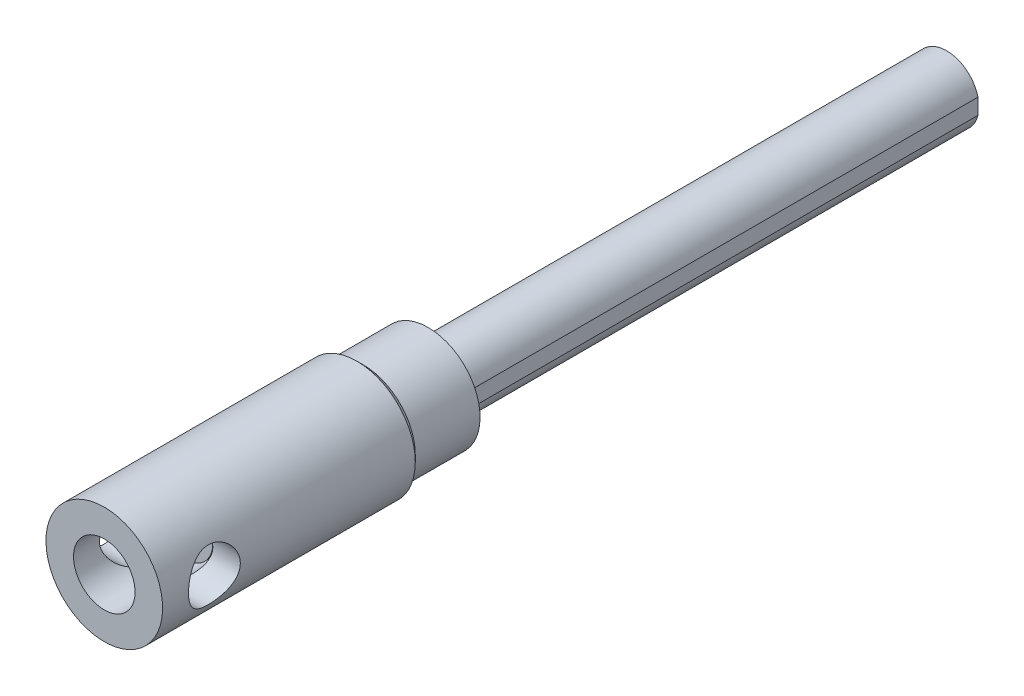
ISO-10303-21;
HEADER;
FILE_DESCRIPTION(('STEP AP214'),'2;1');
FILE_NAME('part.step','',(''),(''),'','','');
FILE_SCHEMA(('AUTOMOTIVE_DESIGN { 1 0 10303 214 1 1 1 1 }'));
ENDSEC;
DATA;
#1=APPLICATION_CONTEXT('core data for automotive mechanical design processes');
#2=APPLICATION_PROTOCOL_DEFINITION('international standard','automotive_design',2000,#1);
#3=PRODUCT_CONTEXT('',#1,'mechanical');
#4=PRODUCT('Part','Part','',(#3));
#5=PRODUCT_RELATED_PRODUCT_CATEGORY('part','',(#4));
#6=PRODUCT_DEFINITION_FORMATION('','',#4);
#7=PRODUCT_DEFINITION_CONTEXT('part definition',#1,'design');
#8=PRODUCT_DEFINITION('design','',#6,#7);
#9=PRODUCT_DEFINITION_SHAPE('','',#8);
#10=(LENGTH_UNIT() NAMED_UNIT(*) SI_UNIT(.MILLI.,.METRE.));
#11=(NAMED_UNIT(*) PLANE_ANGLE_UNIT() SI_UNIT($,.RADIAN.));
#12=(NAMED_UNIT(*) SI_UNIT($,.STERADIAN.) SOLID_ANGLE_UNIT());
#13=UNCERTAINTY_MEASURE_WITH_UNIT(LENGTH_MEASURE(1.E-05),#10,'distance_accuracy_value','');
#14=(GEOMETRIC_REPRESENTATION_CONTEXT(3) GLOBAL_UNCERTAINTY_ASSIGNED_CONTEXT((#13)) GLOBAL_UNIT_ASSIGNED_CONTEXT((#10,
#11,#12)) REPRESENTATION_CONTEXT('',''));
#15=CARTESIAN_POINT('',(0.,0.,0.));
#16=DIRECTION('',(0.,0.,1.));
#17=DIRECTION('',(1.,0.,0.));
#18=AXIS2_PLACEMENT_3D('',#15,#16,#17);
#19=CARTESIAN_POINT('',(2.3094010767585,0.,115.));
#20=DIRECTION('',(-0.866025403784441,0.5,0.));
#21=DIRECTION('',(-0.5,-0.866025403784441,0.));
#22=AXIS2_PLACEMENT_3D('',#19,#20,#21);
#23=PLANE('',#22);
#24=DIRECTION('',(0.,0.,1.));
#25=VECTOR('',#24,1.);
#26=CARTESIAN_POINT('',(1.15470053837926,-2.,115.));
#27=LINE('',#26,#25);
#28=CARTESIAN_POINT('',(1.15470053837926,-2.,115.));
#29=VERTEX_POINT('',#28);
#30=CARTESIAN_POINT('',(1.15470053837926,-2.,117.5));
#31=VERTEX_POINT('',#30);
#32=EDGE_CURVE('E291',#29,#31,#27,.T.);
#33=ORIENTED_EDGE('',*,*,#32,.T.);
#34=DIRECTION('',(-0.5,-0.866025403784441,0.));
#35=VECTOR('',#34,1.);
#36=CARTESIAN_POINT('',(2.3094010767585,0.,117.5));
#37=LINE('',#36,#35);
#38=CARTESIAN_POINT('',(2.3094010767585,0.,117.5));
#39=VERTEX_POINT('',#38);
#40=EDGE_CURVE('E29',#39,#31,#37,.T.);
#41=ORIENTED_EDGE('',*,*,#40,.F.);
#42=DIRECTION('',(0.,0.,1.));
#43=VECTOR('',#42,1.);
#44=CARTESIAN_POINT('',(2.3094010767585,0.,115.));
#45=LINE('',#44,#43);
#46=CARTESIAN_POINT('',(2.3094010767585,0.,115.));
#47=VERTEX_POINT('',#46);
#48=EDGE_CURVE('E33',#47,#39,#45,.T.);
#49=ORIENTED_EDGE('',*,*,#48,.F.);
#50=DIRECTION('',(-0.5,-0.866025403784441,0.));
#51=VECTOR('',#50,1.);
#52=CARTESIAN_POINT('',(2.3094010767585,0.,115.));
#53=LINE('',#52,#51);
#54=EDGE_CURVE('E252',#47,#29,#53,.T.);
#55=ORIENTED_EDGE('',*,*,#54,.T.);
#56=EDGE_LOOP('',(#33,#41,#49,#55));
#57=FACE_BOUND('',#56,.T.);
#58=ADVANCED_FACE('F14',(#57),#23,.T.);
#59=CARTESIAN_POINT('',(-1.15470053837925,-2.,115.));
#60=DIRECTION('',(0.,-1.,0.));
#61=DIRECTION('',(0.,0.,-1.));
#62=AXIS2_PLACEMENT_3D('',#59,#60,#61);
#63=PLANE('',#62);
#64=DIRECTION('',(0.,0.,1.));
#65=VECTOR('',#64,1.);
#66=CARTESIAN_POINT('',(-1.15470053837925,-2.,115.));
#67=LINE('',#66,#65);
#68=CARTESIAN_POINT('',(-1.15470053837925,-2.,115.));
#69=VERTEX_POINT('',#68);
#70=CARTESIAN_POINT('',(-1.15470053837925,-2.,117.5));
#71=VERTEX_POINT('',#70);
#72=EDGE_CURVE('E289',#69,#71,#67,.T.);
#73=ORIENTED_EDGE('',*,*,#72,.T.);
#74=DIRECTION('',(1.,0.,0.));
#75=VECTOR('',#74,1.);
#76=CARTESIAN_POINT('',(-1.15470053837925,-2.,117.5));
#77=LINE('',#76,#75);
#78=EDGE_CURVE('E262',#71,#31,#77,.T.);
#79=ORIENTED_EDGE('',*,*,#78,.T.);
#80=ORIENTED_EDGE('',*,*,#32,.F.);
#81=DIRECTION('',(1.,0.,0.));
#82=VECTOR('',#81,1.);
#83=CARTESIAN_POINT('',(-1.15470053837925,-2.,115.));
#84=LINE('',#83,#82);
#85=EDGE_CURVE('E278',#69,#29,#84,.T.);
#86=ORIENTED_EDGE('',*,*,#85,.F.);
#87=EDGE_LOOP('',(#73,#79,#80,#86));
#88=FACE_BOUND('',#87,.T.);
#89=ADVANCED_FACE('F166',(#88),#63,.F.);
#90=CARTESIAN_POINT('',(-2.3094010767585,0.,115.));
#91=DIRECTION('',(-0.866025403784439,-0.5,0.));
#92=DIRECTION('',(0.5,-0.866025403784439,0.));
#93=AXIS2_PLACEMENT_3D('',#90,#91,#92);
#94=PLANE('',#93);
#95=DIRECTION('',(0.,0.,1.));
#96=VECTOR('',#95,1.);
#97=CARTESIAN_POINT('',(-2.3094010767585,0.,115.));
#98=LINE('',#97,#96);
#99=CARTESIAN_POINT('',(-2.3094010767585,0.,115.));
#100=VERTEX_POINT('',#99);
#101=CARTESIAN_POINT('',(-2.3094010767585,0.,117.5));
#102=VERTEX_POINT('',#101);
#103=EDGE_CURVE('E287',#100,#102,#98,.T.);
#104=ORIENTED_EDGE('',*,*,#103,.T.);
#105=DIRECTION('',(0.5,-0.866025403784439,0.));
#106=VECTOR('',#105,1.);
#107=CARTESIAN_POINT('',(-2.3094010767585,0.,117.5));
#108=LINE('',#107,#106);
#109=EDGE_CURVE('E259',#102,#71,#108,.T.);
#110=ORIENTED_EDGE('',*,*,#109,.T.);
#111=ORIENTED_EDGE('',*,*,#72,.F.);
#112=DIRECTION('',(0.5,-0.866025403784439,0.));
#113=VECTOR('',#112,1.);
#114=CARTESIAN_POINT('',(-2.3094010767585,0.,115.));
#115=LINE('',#114,#113);
#116=EDGE_CURVE('E275',#100,#69,#115,.T.);
#117=ORIENTED_EDGE('',*,*,#116,.F.);
#118=EDGE_LOOP('',(#104,#110,#111,#117));
#119=FACE_BOUND('',#118,.T.);
#120=ADVANCED_FACE('F171',(#119),#94,.F.);
#121=CARTESIAN_POINT('',(-2.3094010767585,0.,115.));
#122=DIRECTION('',(0.866025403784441,-0.5,0.));
#123=DIRECTION('',(0.5,0.866025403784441,0.));
#124=AXIS2_PLACEMENT_3D('',#121,#122,#123);
#125=PLANE('',#124);
#126=DIRECTION('',(0.,0.,1.));
#127=VECTOR('',#126,1.);
#128=CARTESIAN_POINT('',(-1.15470053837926,2.,115.));
#129=LINE('',#128,#127);
#130=CARTESIAN_POINT('',(-1.15470053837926,2.,115.));
#131=VERTEX_POINT('',#130);
#132=CARTESIAN_POINT('',(-1.15470053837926,2.,117.5));
#133=VERTEX_POINT('',#132);
#134=EDGE_CURVE('E285',#131,#133,#129,.T.);
#135=ORIENTED_EDGE('',*,*,#134,.T.);
#136=DIRECTION('',(0.5,0.866025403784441,0.));
#137=VECTOR('',#136,1.);
#138=CARTESIAN_POINT('',(-2.3094010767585,0.,117.5));
#139=LINE('',#138,#137);
#140=EDGE_CURVE('E256',#102,#133,#139,.T.);
#141=ORIENTED_EDGE('',*,*,#140,.F.);
#142=ORIENTED_EDGE('',*,*,#103,.F.);
#143=DIRECTION('',(0.5,0.866025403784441,0.));
#144=VECTOR('',#143,1.);
#145=CARTESIAN_POINT('',(-2.3094010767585,0.,115.));
#146=LINE('',#145,#144);
#147=EDGE_CURVE('E272',#100,#131,#146,.T.);
#148=ORIENTED_EDGE('',*,*,#147,.T.);
#149=EDGE_LOOP('',(#135,#141,#142,#148));
#150=FACE_BOUND('',#149,.T.);
#151=ADVANCED_FACE('F184',(#150),#125,.T.);
#152=CARTESIAN_POINT('',(1.15470053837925,2.,115.));
#153=DIRECTION('',(0.,1.,0.));
#154=DIRECTION('',(-1.,0.,0.));
#155=AXIS2_PLACEMENT_3D('',#152,#153,#154);
#156=PLANE('',#155);
#157=DIRECTION('',(0.,0.,1.));
#158=VECTOR('',#157,1.);
#159=CARTESIAN_POINT('',(1.15470053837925,2.,115.));
#160=LINE('',#159,#158);
#161=CARTESIAN_POINT('',(1.15470053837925,2.,115.));
#162=VERTEX_POINT('',#161);
#163=CARTESIAN_POINT('',(1.15470053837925,2.,117.5));
#164=VERTEX_POINT('',#163);
#165=EDGE_CURVE('E283',#162,#164,#160,.T.);
#166=ORIENTED_EDGE('',*,*,#165,.T.);
#167=DIRECTION('',(-1.,0.,0.));
#168=VECTOR('',#167,1.);
#169=CARTESIAN_POINT('',(1.15470053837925,2.,117.5));
#170=LINE('',#169,#168);
#171=EDGE_CURVE('E253',#164,#133,#170,.T.);
#172=ORIENTED_EDGE('',*,*,#171,.T.);
#173=ORIENTED_EDGE('',*,*,#134,.F.);
#174=DIRECTION('',(-1.,0.,0.));
#175=VECTOR('',#174,1.);
#176=CARTESIAN_POINT('',(1.15470053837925,2.,115.));
#177=LINE('',#176,#175);
#178=EDGE_CURVE('E269',#162,#131,#177,.T.);
#179=ORIENTED_EDGE('',*,*,#178,.F.);
#180=EDGE_LOOP('',(#166,#172,#173,#179));
#181=FACE_BOUND('',#180,.T.);
#182=ADVANCED_FACE('F180',(#181),#156,.F.);
#183=CARTESIAN_POINT('',(2.3094010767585,0.,115.));
#184=DIRECTION('',(0.866025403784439,0.5,0.));
#185=DIRECTION('',(-0.5,0.866025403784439,0.));
#186=AXIS2_PLACEMENT_3D('',#183,#184,#185);
#187=PLANE('',#186);
#188=DIRECTION('',(-0.5,0.866025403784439,0.));
#189=VECTOR('',#188,1.);
#190=CARTESIAN_POINT('',(2.3094010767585,0.,115.));
#191=LINE('',#190,#189);
#192=EDGE_CURVE('E266',#47,#162,#191,.T.);
#193=ORIENTED_EDGE('',*,*,#192,.F.);
#194=ORIENTED_EDGE('',*,*,#48,.T.);
#195=DIRECTION('',(-0.5,0.866025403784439,0.));
#196=VECTOR('',#195,1.);
#197=CARTESIAN_POINT('',(2.3094010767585,0.,117.5));
#198=LINE('',#197,#196);
#199=EDGE_CURVE('E249',#39,#164,#198,.T.);
#200=ORIENTED_EDGE('',*,*,#199,.T.);
#201=ORIENTED_EDGE('',*,*,#165,.F.);
#202=EDGE_LOOP('',(#193,#194,#200,#201));
#203=FACE_BOUND('',#202,.T.);
#204=ADVANCED_FACE('F177',(#203),#187,.F.);
#205=CARTESIAN_POINT('',(3.46410161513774,2.,115.));
#206=DIRECTION('',(0.,0.,-1.));
#207=DIRECTION('',(0.,1.,0.));
#208=AXIS2_PLACEMENT_3D('',#205,#206,#207);
#209=PLANE('',#208);
#210=ORIENTED_EDGE('',*,*,#54,.F.);
#211=ORIENTED_EDGE('',*,*,#192,.T.);
#212=ORIENTED_EDGE('',*,*,#178,.T.);
#213=ORIENTED_EDGE('',*,*,#147,.F.);
#214=ORIENTED_EDGE('',*,*,#116,.T.);
#215=ORIENTED_EDGE('',*,*,#85,.T.);
#216=EDGE_LOOP('',(#210,#211,#212,#213,#214,#215));
#217=FACE_BOUND('',#216,.T.);
#218=ADVANCED_FACE('F176',(#217),#209,.F.);
#219=CARTESIAN_POINT('',(0.,0.,117.5));
#220=DIRECTION('',(0.,0.,1.));
#221=DIRECTION('',(0.,-1.,0.));
#222=AXIS2_PLACEMENT_3D('',#219,#220,#221);
#223=PLANE('',#222);
#224=CARTESIAN_POINT('',(0.,0.,117.5));
#225=DIRECTION('',(0.,0.,1.));
#226=DIRECTION('',(0.,-1.,0.));
#227=AXIS2_PLACEMENT_3D('',#224,#225,#226);
#228=CIRCLE('',#227,4.25);
#229=CARTESIAN_POINT('',(0.,-4.25,117.5));
#230=VERTEX_POINT('',#229);
#231=EDGE_CURVE('E9',#230,#230,#228,.T.);
#232=ORIENTED_EDGE('',*,*,#231,.T.);
#233=EDGE_LOOP('',(#232));
#234=FACE_BOUND('',#233,.T.);
#235=ORIENTED_EDGE('',*,*,#199,.F.);
#236=ORIENTED_EDGE('',*,*,#40,.T.);
#237=ORIENTED_EDGE('',*,*,#78,.F.);
#238=ORIENTED_EDGE('',*,*,#109,.F.);
#239=ORIENTED_EDGE('',*,*,#140,.T.);
#240=ORIENTED_EDGE('',*,*,#171,.F.);
#241=EDGE_LOOP('',(#235,#236,#237,#238,#239,#240));
#242=FACE_BOUND('',#241,.T.);
#243=ADVANCED_FACE('F16',(#234,#242),#223,.T.);
#244=CARTESIAN_POINT('',(0.,0.,112.5));
#245=DIRECTION('',(0.,0.,1.));
#246=DIRECTION('',(0.,-1.,0.));
#247=AXIS2_PLACEMENT_3D('',#244,#245,#246);
#248=CYLINDRICAL_SURFACE('',#247,4.25);
#249=CARTESIAN_POINT('',(0.,0.,112.5));
#250=DIRECTION('',(0.,0.,1.));
#251=DIRECTION('',(0.,-1.,0.));
#252=AXIS2_PLACEMENT_3D('',#249,#250,#251);
#253=CIRCLE('',#252,4.25);
#254=CARTESIAN_POINT('',(0.,-4.25,112.5));
#255=VERTEX_POINT('',#254);
#256=EDGE_CURVE('E22',#255,#255,#253,.T.);
#257=ORIENTED_EDGE('',*,*,#256,.T.);
#258=EDGE_LOOP('',(#257));
#259=FACE_BOUND('',#258,.T.);
#260=ORIENTED_EDGE('',*,*,#231,.F.);
#261=EDGE_LOOP('',(#260));
#262=FACE_BOUND('',#261,.T.);
#263=ADVANCED_FACE('F191',(#259,#262),#248,.T.);
#264=CARTESIAN_POINT('',(0.,0.,0.));
#265=DIRECTION('',(0.,0.,1.));
#266=DIRECTION('',(-1.,0.,0.));
#267=AXIS2_PLACEMENT_3D('',#264,#265,#266);
#268=PLANE('',#267);
#269=DIRECTION('',(0.,-1.,0.));
#270=VECTOR('',#269,1.);
#271=CARTESIAN_POINT('',(4.85,-1.21552457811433,0.));
#272=LINE('',#271,#270);
#273=CARTESIAN_POINT('',(4.85,1.21552457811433,0.));
#274=VERTEX_POINT('',#273);
#275=CARTESIAN_POINT('',(4.85,-1.21552457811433,0.));
#276=VERTEX_POINT('',#275);
#277=EDGE_CURVE('E91',#274,#276,#272,.T.);
#278=ORIENTED_EDGE('',*,*,#277,.T.);
#279=CARTESIAN_POINT('',(0.,0.,0.));
#280=DIRECTION('',(0.,0.,1.));
#281=DIRECTION('',(-1.,0.,0.));
#282=AXIS2_PLACEMENT_3D('',#279,#280,#281);
#283=CIRCLE('',#282,5.);
#284=EDGE_CURVE('E83',#274,#276,#283,.T.);
#285=ORIENTED_EDGE('',*,*,#284,.F.);
#286=EDGE_LOOP('',(#278,#285));
#287=FACE_BOUND('',#286,.T.);
#288=ADVANCED_FACE('F95',(#287),#268,.F.);
#289=CARTESIAN_POINT('',(4.85,-1.21552457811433,100.));
#290=DIRECTION('',(1.,0.,0.));
#291=DIRECTION('',(0.,0.,1.));
#292=AXIS2_PLACEMENT_3D('',#289,#290,#291);
#293=PLANE('',#292);
#294=DIRECTION('',(0.,1.,0.));
#295=VECTOR('',#294,1.);
#296=CARTESIAN_POINT('',(4.85,8.,80.));
#297=LINE('',#296,#295);
#298=CARTESIAN_POINT('',(4.85,-1.21552457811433,80.));
#299=VERTEX_POINT('',#298);
#300=CARTESIAN_POINT('',(4.85,1.21552457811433,80.));
#301=VERTEX_POINT('',#300);
#302=EDGE_CURVE('E246',#299,#301,#297,.T.);
#303=ORIENTED_EDGE('',*,*,#302,.F.);
#304=DIRECTION('',(0.,0.,-1.));
#305=VECTOR('',#304,1.);
#306=CARTESIAN_POINT('',(4.85,-1.21552457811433,100.));
#307=LINE('',#306,#305);
#308=EDGE_CURVE('E88',#299,#276,#307,.T.);
#309=ORIENTED_EDGE('',*,*,#308,.T.);
#310=ORIENTED_EDGE('',*,*,#277,.F.);
#311=DIRECTION('',(0.,0.,-1.));
#312=VECTOR('',#311,1.);
#313=CARTESIAN_POINT('',(4.85,1.21552457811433,100.));
#314=LINE('',#313,#312);
#315=EDGE_CURVE('E78',#301,#274,#314,.T.);
#316=ORIENTED_EDGE('',*,*,#315,.F.);
#317=EDGE_LOOP('',(#303,#309,#310,#316));
#318=FACE_BOUND('',#317,.T.);
#319=ADVANCED_FACE('F92',(#318),#293,.T.);
#320=CARTESIAN_POINT('',(0.,0.,100.));
#321=DIRECTION('',(0.,0.,-1.));
#322=DIRECTION('',(1.,0.,0.));
#323=AXIS2_PLACEMENT_3D('',#320,#321,#322);
#324=CYLINDRICAL_SURFACE('',#323,5.);
#325=ORIENTED_EDGE('',*,*,#308,.F.);
#326=CARTESIAN_POINT('',(0.,0.,80.));
#327=DIRECTION('',(0.,0.,1.));
#328=DIRECTION('',(1.025516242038E-09,-1.,0.));
#329=AXIS2_PLACEMENT_3D('',#326,#327,#328);
#330=CIRCLE('',#329,5.);
#331=EDGE_CURVE('E84',#299,#301,#330,.F.);
#332=ORIENTED_EDGE('',*,*,#331,.T.);
#333=ORIENTED_EDGE('',*,*,#315,.T.);
#334=ORIENTED_EDGE('',*,*,#284,.T.);
#335=EDGE_LOOP('',(#325,#332,#333,#334));
#336=FACE_BOUND('',#335,.T.);
#337=ADVANCED_FACE('F81',(#336),#324,.T.);
#338=CARTESIAN_POINT('',(0.,8.,80.));
#339=DIRECTION('',(0.,0.,1.));
#340=DIRECTION('',(0.,-1.,0.));
#341=AXIS2_PLACEMENT_3D('',#338,#339,#340);
#342=PLANE('',#341);
#343=CARTESIAN_POINT('',(0.,0.,80.));
#344=DIRECTION('',(0.,0.,-1.));
#345=DIRECTION('',(0.,1.,0.));
#346=AXIS2_PLACEMENT_3D('',#343,#344,#345);
#347=CIRCLE('',#346,8.);
#348=CARTESIAN_POINT('',(0.,8.,80.));
#349=VERTEX_POINT('',#348);
#350=EDGE_CURVE('E222',#349,#349,#347,.T.);
#351=ORIENTED_EDGE('',*,*,#350,.T.);
#352=EDGE_LOOP('',(#351));
#353=FACE_BOUND('',#352,.T.);
#354=ORIENTED_EDGE('',*,*,#331,.F.);
#355=ORIENTED_EDGE('',*,*,#302,.T.);
#356=EDGE_LOOP('',(#354,#355));
#357=FACE_BOUND('',#356,.T.);
#358=ADVANCED_FACE('F126',(#353,#357),#342,.F.);
#359=CARTESIAN_POINT('',(0.,0.,80.));
#360=DIRECTION('',(0.,0.,-1.));
#361=DIRECTION('',(0.,1.,0.));
#362=AXIS2_PLACEMENT_3D('',#359,#360,#361);
#363=CYLINDRICAL_SURFACE('',#362,8.);
#364=ORIENTED_EDGE('',*,*,#350,.F.);
#365=EDGE_LOOP('',(#364));
#366=FACE_BOUND('',#365,.T.);
#367=CARTESIAN_POINT('',(0.,0.,90.));
#368=DIRECTION('',(0.,0.,-1.));
#369=DIRECTION('',(0.,1.,0.));
#370=AXIS2_PLACEMENT_3D('',#367,#368,#369);
#371=CIRCLE('',#370,8.);
#372=CARTESIAN_POINT('',(0.,8.,90.));
#373=VERTEX_POINT('',#372);
#374=EDGE_CURVE('E220',#373,#373,#371,.T.);
#375=ORIENTED_EDGE('',*,*,#374,.T.);
#376=EDGE_LOOP('',(#375));
#377=FACE_BOUND('',#376,.T.);
#378=ADVANCED_FACE('F151',(#366,#377),#363,.T.);
#379=CARTESIAN_POINT('',(0.,0.,90.));
#380=DIRECTION('',(0.,0.,1.));
#381=DIRECTION('',(0.,-1.,0.));
#382=AXIS2_PLACEMENT_3D('',#379,#380,#381);
#383=CONICAL_SURFACE('',#382,8.,0.785398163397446);
#384=CARTESIAN_POINT('',(0.,0.,91.));
#385=DIRECTION('',(0.,0.,1.));
#386=DIRECTION('',(0.,-1.,0.));
#387=AXIS2_PLACEMENT_3D('',#384,#385,#386);
#388=CIRCLE('',#387,9.);
#389=CARTESIAN_POINT('',(0.,-9.,91.));
#390=VERTEX_POINT('',#389);
#391=EDGE_CURVE('E145',#390,#390,#388,.T.);
#392=ORIENTED_EDGE('',*,*,#391,.F.);
#393=EDGE_LOOP('',(#392));
#394=FACE_BOUND('',#393,.T.);
#395=ORIENTED_EDGE('',*,*,#374,.F.);
#396=EDGE_LOOP('',(#395));
#397=FACE_BOUND('',#396,.T.);
#398=ADVANCED_FACE('F124',(#394,#397),#383,.T.);
#399=CARTESIAN_POINT('',(0.,0.,80.));
#400=DIRECTION('',(0.,0.,-1.));
#401=DIRECTION('',(0.,1.,0.));
#402=AXIS2_PLACEMENT_3D('',#399,#400,#401);
#403=CYLINDRICAL_SURFACE('',#402,9.);
#404=ORIENTED_EDGE('',*,*,#391,.T.);
#405=EDGE_LOOP('',(#404));
#406=FACE_BOUND('',#405,.T.);
#407=CARTESIAN_POINT('',(-9.,0.,126.));
#408=CARTESIAN_POINT('',(-8.99999931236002,-0.106543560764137,125.999999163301));
#409=CARTESIAN_POINT('',(-8.99810295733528,-0.21311453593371,125.995737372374));
#410=CARTESIAN_POINT('',(-8.99056534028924,-0.425487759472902,125.978733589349));
#411=CARTESIAN_POINT('',(-8.9849219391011,-0.531289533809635,125.965986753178));
#412=CARTESIAN_POINT('',(-8.97002203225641,-0.741497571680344,125.932115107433));
#413=CARTESIAN_POINT('',(-8.96075877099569,-0.8459008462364,125.910974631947));
#414=CARTESIAN_POINT('',(-8.93886560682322,-1.05237393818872,125.860547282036));
#415=CARTESIAN_POINT('',(-8.92623432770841,-1.15444278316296,125.831257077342));
#416=CARTESIAN_POINT('',(-8.88385509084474,-1.45528706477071,125.731826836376));
#417=CARTESIAN_POINT('',(-8.84954694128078,-1.64969223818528,125.649964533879));
#418=CARTESIAN_POINT('',(-8.7720569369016,-2.02169397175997,125.457842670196));
#419=CARTESIAN_POINT('',(-8.7288771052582,-2.1992943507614,125.34758958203));
#420=CARTESIAN_POINT('',(-8.63520005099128,-2.5429519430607,125.095329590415));
#421=CARTESIAN_POINT('',(-8.58444255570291,-2.70796463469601,124.951994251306));
#422=CARTESIAN_POINT('',(-8.48237167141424,-3.01251193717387,124.640513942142));
#423=CARTESIAN_POINT('',(-8.43105797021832,-3.15203136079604,124.472354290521));
#424=CARTESIAN_POINT('',(-8.33031613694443,-3.40970641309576,124.10407902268));
#425=CARTESIAN_POINT('',(-8.28116793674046,-3.52616342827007,123.902678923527));
#426=CARTESIAN_POINT('',(-8.21620901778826,-3.67379855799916,123.58644164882));
#427=CARTESIAN_POINT('',(-8.19601074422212,-3.7185134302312,123.478630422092));
#428=CARTESIAN_POINT('',(-8.15924882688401,-3.79849956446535,123.258980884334));
#429=CARTESIAN_POINT('',(-8.14268322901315,-3.83377590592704,123.147144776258));
#430=CARTESIAN_POINT('',(-8.11458487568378,-3.89288163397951,122.926209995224));
#431=CARTESIAN_POINT('',(-8.10283476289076,-3.91721191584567,122.8172725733));
#432=CARTESIAN_POINT('',(-8.08362129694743,-3.95670961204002,122.59742166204));
#433=CARTESIAN_POINT('',(-8.07615587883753,-3.97188144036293,122.486509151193));
#434=CARTESIAN_POINT('',(-8.06579894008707,-3.99287182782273,122.263627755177));
#435=CARTESIAN_POINT('',(-8.06290582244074,-3.99869365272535,122.151659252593));
#436=CARTESIAN_POINT('',(-8.06180452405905,-4.0009136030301,121.927610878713));
#437=CARTESIAN_POINT('',(-8.06359604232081,-3.9973123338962,121.815531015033));
#438=CARTESIAN_POINT('',(-8.0714233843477,-3.98148137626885,121.602272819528));
#439=CARTESIAN_POINT('',(-8.07706352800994,-3.97005575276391,121.501019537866));
#440=CARTESIAN_POINT('',(-8.09197245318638,-3.93957606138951,121.299928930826));
#441=CARTESIAN_POINT('',(-8.10124240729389,-3.92051952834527,121.200092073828));
#442=CARTESIAN_POINT('',(-8.13408651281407,-3.85217674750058,120.903762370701));
#443=CARTESIAN_POINT('',(-8.16270181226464,-3.79170447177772,120.710282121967));
#444=CARTESIAN_POINT('',(-8.23081734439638,-3.64150006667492,120.332101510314));
#445=CARTESIAN_POINT('',(-8.27054749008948,-3.55114161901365,120.147695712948));
#446=CARTESIAN_POINT('',(-8.35638151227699,-3.3441634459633,119.795856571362));
#447=CARTESIAN_POINT('',(-8.40248806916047,-3.22753266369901,119.62843041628));
#448=CARTESIAN_POINT('',(-8.50133279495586,-2.95801583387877,119.298170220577));
#449=CARTESIAN_POINT('',(-8.5542794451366,-2.80270476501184,119.137372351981));
#450=CARTESIAN_POINT('',(-8.65709798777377,-2.46687651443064,118.843365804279));
#451=CARTESIAN_POINT('',(-8.70696894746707,-2.28635173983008,118.710165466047));
#452=CARTESIAN_POINT('',(-8.79984898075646,-1.89830549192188,118.471573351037));
#453=CARTESIAN_POINT('',(-8.84261183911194,-1.69014406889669,118.367119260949));
#454=CARTESIAN_POINT('',(-8.91451161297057,-1.25681485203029,118.195446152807));
#455=CARTESIAN_POINT('',(-8.94365711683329,-1.03165788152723,118.128203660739));
#456=CARTESIAN_POINT('',(-8.98336516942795,-0.587641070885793,118.037376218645));
#457=CARTESIAN_POINT('',(-8.99508492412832,-0.369442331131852,118.011066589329));
#458=CARTESIAN_POINT('',(-9.00240007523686,0.0685540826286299,117.994593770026));
#459=CARTESIAN_POINT('',(-8.99800094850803,0.288351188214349,118.004418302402));
#460=CARTESIAN_POINT('',(-8.97430591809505,0.709814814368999,118.058087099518));
#461=CARTESIAN_POINT('',(-8.95589038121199,0.911792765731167,118.099921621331));
#462=CARTESIAN_POINT('',(-8.90701082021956,1.30558421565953,118.213516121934));
#463=CARTESIAN_POINT('',(-8.87654533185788,1.4973964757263,118.285279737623));
#464=CARTESIAN_POINT('',(-8.80524764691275,1.87220783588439,118.45897713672));
#465=CARTESIAN_POINT('',(-8.76412168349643,2.05474529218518,118.56178231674));
#466=CARTESIAN_POINT('',(-8.67576208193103,2.40063957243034,118.793705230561));
#467=CARTESIAN_POINT('',(-8.62852578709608,2.56398799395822,118.92283442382));
#468=CARTESIAN_POINT('',(-8.52825739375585,2.88073032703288,119.215823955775));
#469=CARTESIAN_POINT('',(-8.47506500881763,3.03226090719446,119.381644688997));
#470=CARTESIAN_POINT('',(-8.37207677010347,3.30602071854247,119.737147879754));
#471=CARTESIAN_POINT('',(-8.32228212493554,3.42823956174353,119.926838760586));
#472=CARTESIAN_POINT('',(-8.25404075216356,3.58807434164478,120.228245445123));
#473=CARTESIAN_POINT('',(-8.23214803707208,3.63788387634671,120.332879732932));
#474=CARTESIAN_POINT('',(-8.19154569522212,3.72840991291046,120.546588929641));
#475=CARTESIAN_POINT('',(-8.17283464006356,3.76913049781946,120.655661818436));
#476=CARTESIAN_POINT('',(-8.13929816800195,3.84101557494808,120.877421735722));
#477=CARTESIAN_POINT('',(-8.12447050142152,3.87218560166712,120.990106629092));
#478=CARTESIAN_POINT('',(-8.0992771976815,3.92460929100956,121.218249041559));
#479=CARTESIAN_POINT('',(-8.08891105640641,3.94586407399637,121.33370624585));
#480=CARTESIAN_POINT('',(-8.07374935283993,3.97678770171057,121.556479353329));
#481=CARTESIAN_POINT('',(-8.06855529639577,3.98728755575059,121.663653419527));
#482=CARTESIAN_POINT('',(-8.06245450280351,3.99960939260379,121.87865985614));
#483=CARTESIAN_POINT('',(-8.06154919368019,4.00142848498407,121.986492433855));
#484=CARTESIAN_POINT('',(-8.06406616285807,3.99635429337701,122.201844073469));
#485=CARTESIAN_POINT('',(-8.06748593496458,3.98946605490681,122.309363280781));
#486=CARTESIAN_POINT('',(-8.07851431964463,3.96708318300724,122.523297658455));
#487=CARTESIAN_POINT('',(-8.08612450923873,3.95158530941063,122.629712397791));
#488=CARTESIAN_POINT('',(-8.11370655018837,3.89481025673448,122.933253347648));
#489=CARTESIAN_POINT('',(-8.13866591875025,3.8428451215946,123.128043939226));
#490=CARTESIAN_POINT('',(-8.19957700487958,3.71108221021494,123.505998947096));
#491=CARTESIAN_POINT('',(-8.23553189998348,3.6312763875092,123.689159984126));
#492=CARTESIAN_POINT('',(-8.31722161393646,3.44024324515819,124.051664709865));
#493=CARTESIAN_POINT('',(-8.36343549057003,3.32733013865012,124.230011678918));
#494=CARTESIAN_POINT('',(-8.45929191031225,3.07546946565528,124.566253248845));
#495=CARTESIAN_POINT('',(-8.50893588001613,2.93651102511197,124.724139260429));
#496=CARTESIAN_POINT('',(-8.61126362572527,2.62217220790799,125.029240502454));
#497=CARTESIAN_POINT('',(-8.66383343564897,2.44466910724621,125.174314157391));
#498=CARTESIAN_POINT('',(-8.76186799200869,2.0658662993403,125.432884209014));
#499=CARTESIAN_POINT('',(-8.80732948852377,1.86455578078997,125.546366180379));
#500=CARTESIAN_POINT('',(-8.86614466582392,1.55009155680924,125.689219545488));
#501=CARTESIAN_POINT('',(-8.88411858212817,1.44376115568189,125.732125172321));
#502=CARTESIAN_POINT('',(-8.91658812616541,1.2273511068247,125.808773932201));
#503=CARTESIAN_POINT('',(-8.93108542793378,1.1172732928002,125.842521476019));
#504=CARTESIAN_POINT('',(-8.95614098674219,0.894475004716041,125.900402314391));
#505=CARTESIAN_POINT('',(-8.96670865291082,0.781761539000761,125.924558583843));
#506=CARTESIAN_POINT('',(-8.98362931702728,0.554414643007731,125.963066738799));
#507=CARTESIAN_POINT('',(-8.98998524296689,0.439782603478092,125.977425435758));
#508=CARTESIAN_POINT('',(-8.99608997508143,0.270722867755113,125.99119614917));
#509=CARTESIAN_POINT('',(-8.99755504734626,0.216644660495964,125.994496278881));
#510=CARTESIAN_POINT('',(-8.99951024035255,0.108380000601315,125.998898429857));
#511=CARTESIAN_POINT('',(-9.00000034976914,0.0541935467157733,126.000000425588));
#512=CARTESIAN_POINT('',(-9.,0.,126.));
#513=B_SPLINE_CURVE_WITH_KNOTS('',3,(#407,#408,#409,#410,#411,#412,#413,#414,#415,#416,#417,
#418,#419,#420,#421,#422,#423,#424,#425,#426,#427,#428,#429,#430,#431,#432,#433,#434,#435,#436,
#437,#438,#439,#440,#441,#442,#443,#444,#445,#446,#447,#448,#449,#450,#451,#452,#453,#454,#455,
#456,#457,#458,#459,#460,#461,#462,#463,#464,#465,#466,#467,#468,#469,#470,#471,#472,#473,#474,
#475,#476,#477,#478,#479,#480,#481,#482,#483,#484,#485,#486,#487,#488,#489,#490,#491,#492,#493,
#494,#495,#496,#497,#498,#499,#500,#501,#502,#503,#504,#505,#506,#507,#508,#509,#510,#511,#512),
.UNSPECIFIED.,.T.,.F.,(4,2,2,2,2,2,2,2,2,2,2,2,2,2,2,2,2,2,2,2,2,2,2,2,2,2,2,2,2,2,2,2,2,2,2,2,
2,2,2,2,2,2,2,2,2,2,2,2,2,2,2,2,4),(0.,0.319575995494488,0.639334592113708,0.959692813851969,
1.28018213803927,1.91817504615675,2.55602262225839,3.22626867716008,3.89691272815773,
4.60627839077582,4.96122462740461,5.31597945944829,5.6522395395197,5.98833742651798,
6.32431789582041,6.66027677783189,6.96605959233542,7.2719412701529,7.88320420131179,
8.5081879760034,9.13343527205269,9.81959120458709,10.5059542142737,11.2125921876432,
11.9187838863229,12.5755805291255,13.2321540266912,13.8505799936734,14.4690811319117,
15.1068781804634,15.7449534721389,16.4344546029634,17.1241997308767,17.4776093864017,
17.8308599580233,18.1839054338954,18.536911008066,18.8599212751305,19.1830390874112,
19.5059697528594,19.8290220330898,20.4355356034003,21.042224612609,21.6877902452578,
22.3336260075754,23.0359566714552,23.7386075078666,24.0863996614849,24.4340240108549,
24.7808105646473,25.127355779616,25.2899067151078,25.452459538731),.UNSPECIFIED.);
#514=CARTESIAN_POINT('',(-9.,0.,126.));
#515=VERTEX_POINT('',#514);
#516=EDGE_CURVE('E139',#515,#515,#513,.T.);
#517=ORIENTED_EDGE('',*,*,#516,.T.);
#518=EDGE_LOOP('',(#517));
#519=FACE_BOUND('',#518,.T.);
#520=CARTESIAN_POINT('',(9.,0.,126.));
#521=CARTESIAN_POINT('',(8.99999931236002,0.106543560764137,125.999999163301));
#522=CARTESIAN_POINT('',(8.99810295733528,0.21311453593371,125.995737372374));
#523=CARTESIAN_POINT('',(8.99056534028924,0.425487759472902,125.978733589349));
#524=CARTESIAN_POINT('',(8.9849219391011,0.531289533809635,125.965986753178));
#525=CARTESIAN_POINT('',(8.97002203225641,0.741497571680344,125.932115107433));
#526=CARTESIAN_POINT('',(8.96075877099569,0.8459008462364,125.910974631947));
#527=CARTESIAN_POINT('',(8.93886560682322,1.05237393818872,125.860547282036));
#528=CARTESIAN_POINT('',(8.92623432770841,1.15444278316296,125.831257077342));
#529=CARTESIAN_POINT('',(8.88385509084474,1.45528706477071,125.731826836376));
#530=CARTESIAN_POINT('',(8.84954694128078,1.64969223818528,125.649964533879));
#531=CARTESIAN_POINT('',(8.7720569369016,2.02169397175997,125.457842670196));
#532=CARTESIAN_POINT('',(8.7288771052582,2.1992943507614,125.34758958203));
#533=CARTESIAN_POINT('',(8.63520005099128,2.5429519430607,125.095329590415));
#534=CARTESIAN_POINT('',(8.58444255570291,2.70796463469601,124.951994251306));
#535=CARTESIAN_POINT('',(8.48237167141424,3.01251193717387,124.640513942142));
#536=CARTESIAN_POINT('',(8.43105797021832,3.15203136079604,124.472354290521));
#537=CARTESIAN_POINT('',(8.33031613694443,3.40970641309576,124.10407902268));
#538=CARTESIAN_POINT('',(8.28116793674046,3.52616342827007,123.902678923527));
#539=CARTESIAN_POINT('',(8.21620901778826,3.67379855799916,123.58644164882));
#540=CARTESIAN_POINT('',(8.19601074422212,3.7185134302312,123.478630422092));
#541=CARTESIAN_POINT('',(8.15924882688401,3.79849956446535,123.258980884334));
#542=CARTESIAN_POINT('',(8.14268322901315,3.83377590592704,123.147144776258));
#543=CARTESIAN_POINT('',(8.11458487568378,3.89288163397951,122.926209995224));
#544=CARTESIAN_POINT('',(8.10283476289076,3.91721191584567,122.8172725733));
#545=CARTESIAN_POINT('',(8.08362129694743,3.95670961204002,122.59742166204));
#546=CARTESIAN_POINT('',(8.07615587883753,3.97188144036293,122.486509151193));
#547=CARTESIAN_POINT('',(8.06579894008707,3.99287182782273,122.263627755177));
#548=CARTESIAN_POINT('',(8.06290582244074,3.99869365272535,122.151659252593));
#549=CARTESIAN_POINT('',(8.06180452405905,4.0009136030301,121.927610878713));
#550=CARTESIAN_POINT('',(8.06359604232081,3.9973123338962,121.815531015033));
#551=CARTESIAN_POINT('',(8.0714233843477,3.98148137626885,121.602272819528));
#552=CARTESIAN_POINT('',(8.07706352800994,3.97005575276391,121.501019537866));
#553=CARTESIAN_POINT('',(8.09197245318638,3.93957606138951,121.299928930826));
#554=CARTESIAN_POINT('',(8.10124240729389,3.92051952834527,121.200092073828));
#555=CARTESIAN_POINT('',(8.13408651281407,3.85217674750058,120.903762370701));
#556=CARTESIAN_POINT('',(8.16270181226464,3.79170447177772,120.710282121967));
#557=CARTESIAN_POINT('',(8.23081734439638,3.64150006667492,120.332101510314));
#558=CARTESIAN_POINT('',(8.27054749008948,3.55114161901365,120.147695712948));
#559=CARTESIAN_POINT('',(8.35638151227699,3.3441634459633,119.795856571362));
#560=CARTESIAN_POINT('',(8.40248806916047,3.22753266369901,119.62843041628));
#561=CARTESIAN_POINT('',(8.50133279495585,2.95801583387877,119.298170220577));
#562=CARTESIAN_POINT('',(8.5542794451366,2.80270476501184,119.137372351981));
#563=CARTESIAN_POINT('',(8.65709798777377,2.46687651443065,118.843365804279));
#564=CARTESIAN_POINT('',(8.70696894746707,2.28635173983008,118.710165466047));
#565=CARTESIAN_POINT('',(8.79984898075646,1.89830549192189,118.471573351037));
#566=CARTESIAN_POINT('',(8.84261183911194,1.6901440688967,118.367119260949));
#567=CARTESIAN_POINT('',(8.91451161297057,1.25681485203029,118.195446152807));
#568=CARTESIAN_POINT('',(8.94365711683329,1.03165788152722,118.128203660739));
#569=CARTESIAN_POINT('',(8.98336516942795,0.587641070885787,118.037376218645));
#570=CARTESIAN_POINT('',(8.99508492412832,0.369442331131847,118.011066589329));
#571=CARTESIAN_POINT('',(9.00240007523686,-0.0685540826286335,117.994593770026));
#572=CARTESIAN_POINT('',(8.99800094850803,-0.288351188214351,118.004418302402));
#573=CARTESIAN_POINT('',(8.97430591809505,-0.709814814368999,118.058087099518));
#574=CARTESIAN_POINT('',(8.95589038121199,-0.911792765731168,118.099921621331));
#575=CARTESIAN_POINT('',(8.90701082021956,-1.30558421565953,118.213516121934));
#576=CARTESIAN_POINT('',(8.87654533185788,-1.4973964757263,118.285279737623));
#577=CARTESIAN_POINT('',(8.80524764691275,-1.87220783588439,118.45897713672));
#578=CARTESIAN_POINT('',(8.76412168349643,-2.05474529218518,118.56178231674));
#579=CARTESIAN_POINT('',(8.67576208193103,-2.40063957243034,118.793705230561));
#580=CARTESIAN_POINT('',(8.62852578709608,-2.56398799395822,118.92283442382));
#581=CARTESIAN_POINT('',(8.52825739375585,-2.88073032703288,119.215823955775));
#582=CARTESIAN_POINT('',(8.47506500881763,-3.03226090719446,119.381644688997));
#583=CARTESIAN_POINT('',(8.37207677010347,-3.30602071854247,119.737147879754));
#584=CARTESIAN_POINT('',(8.32228212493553,-3.42823956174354,119.926838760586));
#585=CARTESIAN_POINT('',(8.25404075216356,-3.58807434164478,120.228245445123));
#586=CARTESIAN_POINT('',(8.23214803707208,-3.63788387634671,120.332879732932));
#587=CARTESIAN_POINT('',(8.19154569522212,-3.72840991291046,120.546588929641));
#588=CARTESIAN_POINT('',(8.17283464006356,-3.76913049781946,120.655661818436));
#589=CARTESIAN_POINT('',(8.13929816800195,-3.84101557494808,120.877421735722));
#590=CARTESIAN_POINT('',(8.12447050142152,-3.87218560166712,120.990106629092));
#591=CARTESIAN_POINT('',(8.0992771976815,-3.92460929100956,121.218249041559));
#592=CARTESIAN_POINT('',(8.08891105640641,-3.94586407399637,121.33370624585));
#593=CARTESIAN_POINT('',(8.07374935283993,-3.97678770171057,121.556479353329));
#594=CARTESIAN_POINT('',(8.06855529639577,-3.98728755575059,121.663653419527));
#595=CARTESIAN_POINT('',(8.06245450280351,-3.99960939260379,121.87865985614));
#596=CARTESIAN_POINT('',(8.06154919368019,-4.00142848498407,121.986492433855));
#597=CARTESIAN_POINT('',(8.06406616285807,-3.99635429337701,122.201844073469));
#598=CARTESIAN_POINT('',(8.06748593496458,-3.98946605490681,122.309363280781));
#599=CARTESIAN_POINT('',(8.07851431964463,-3.96708318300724,122.523297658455));
#600=CARTESIAN_POINT('',(8.08612450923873,-3.95158530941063,122.629712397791));
#601=CARTESIAN_POINT('',(8.11370655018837,-3.89481025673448,122.933253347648));
#602=CARTESIAN_POINT('',(8.13866591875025,-3.8428451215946,123.128043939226));
#603=CARTESIAN_POINT('',(8.19957700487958,-3.71108221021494,123.505998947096));
#604=CARTESIAN_POINT('',(8.23553189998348,-3.6312763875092,123.689159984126));
#605=CARTESIAN_POINT('',(8.31722161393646,-3.44024324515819,124.051664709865));
#606=CARTESIAN_POINT('',(8.36343549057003,-3.32733013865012,124.230011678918));
#607=CARTESIAN_POINT('',(8.45929191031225,-3.07546946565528,124.566253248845));
#608=CARTESIAN_POINT('',(8.50893588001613,-2.93651102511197,124.724139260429));
#609=CARTESIAN_POINT('',(8.61126362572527,-2.62217220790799,125.029240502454));
#610=CARTESIAN_POINT('',(8.66383343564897,-2.44466910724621,125.174314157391));
#611=CARTESIAN_POINT('',(8.76186799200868,-2.0658662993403,125.432884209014));
#612=CARTESIAN_POINT('',(8.80732948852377,-1.86455578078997,125.546366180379));
#613=CARTESIAN_POINT('',(8.86614466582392,-1.55009155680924,125.689219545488));
#614=CARTESIAN_POINT('',(8.88411858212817,-1.44376115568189,125.732125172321));
#615=CARTESIAN_POINT('',(8.9165881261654,-1.2273511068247,125.808773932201));
#616=CARTESIAN_POINT('',(8.93108542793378,-1.1172732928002,125.842521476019));
#617=CARTESIAN_POINT('',(8.95614098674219,-0.894475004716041,125.900402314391));
#618=CARTESIAN_POINT('',(8.96670865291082,-0.781761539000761,125.924558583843));
#619=CARTESIAN_POINT('',(8.98362931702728,-0.554414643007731,125.963066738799));
#620=CARTESIAN_POINT('',(8.98998524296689,-0.439782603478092,125.977425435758));
#621=CARTESIAN_POINT('',(8.99608997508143,-0.270722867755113,125.99119614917));
#622=CARTESIAN_POINT('',(8.99755504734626,-0.216644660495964,125.994496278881));
#623=CARTESIAN_POINT('',(8.99951024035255,-0.108380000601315,125.998898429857));
#624=CARTESIAN_POINT('',(9.00000034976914,-0.0541935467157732,126.000000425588));
#625=CARTESIAN_POINT('',(9.,0.,126.));
#626=B_SPLINE_CURVE_WITH_KNOTS('',3,(#520,#521,#522,#523,#524,#525,#526,#527,#528,#529,#530,
#531,#532,#533,#534,#535,#536,#537,#538,#539,#540,#541,#542,#543,#544,#545,#546,#547,#548,#549,
#550,#551,#552,#553,#554,#555,#556,#557,#558,#559,#560,#561,#562,#563,#564,#565,#566,#567,#568,
#569,#570,#571,#572,#573,#574,#575,#576,#577,#578,#579,#580,#581,#582,#583,#584,#585,#586,#587,
#588,#589,#590,#591,#592,#593,#594,#595,#596,#597,#598,#599,#600,#601,#602,#603,#604,#605,#606,
#607,#608,#609,#610,#611,#612,#613,#614,#615,#616,#617,#618,#619,#620,#621,#622,#623,#624,#625),
.UNSPECIFIED.,.T.,.F.,(4,2,2,2,2,2,2,2,2,2,2,2,2,2,2,2,2,2,2,2,2,2,2,2,2,2,2,2,2,2,2,2,2,2,2,2,
2,2,2,2,2,2,2,2,2,2,2,2,2,2,2,2,4),(0.,0.319575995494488,0.639334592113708,0.959692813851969,
1.28018213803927,1.91817504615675,2.55602262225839,3.22626867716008,3.89691272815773,
4.60627839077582,4.96122462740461,5.31597945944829,5.6522395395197,5.98833742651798,
6.32431789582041,6.66027677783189,6.96605959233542,7.2719412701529,7.88320420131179,
8.5081879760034,9.13343527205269,9.81959120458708,10.5059542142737,11.2125921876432,
11.9187838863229,12.5755805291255,13.2321540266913,13.8505799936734,14.4690811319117,
15.1068781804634,15.7449534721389,16.4344546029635,17.1241997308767,17.4776093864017,
17.8308599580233,18.1839054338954,18.536911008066,18.8599212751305,19.1830390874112,
19.5059697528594,19.8290220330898,20.4355356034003,21.042224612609,21.6877902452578,
22.3336260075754,23.0359566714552,23.7386075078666,24.0863996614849,24.4340240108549,
24.7808105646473,25.127355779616,25.2899067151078,25.452459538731),.UNSPECIFIED.);
#627=CARTESIAN_POINT('',(9.,0.,126.));
#628=VERTEX_POINT('',#627);
#629=EDGE_CURVE('E131',#628,#628,#626,.T.);
#630=ORIENTED_EDGE('',*,*,#629,.T.);
#631=EDGE_LOOP('',(#630));
#632=FACE_BOUND('',#631,.T.);
#633=CARTESIAN_POINT('',(0.,0.,130.));
#634=DIRECTION('',(0.,0.,-1.));
#635=DIRECTION('',(0.,1.,0.));
#636=AXIS2_PLACEMENT_3D('',#633,#634,#635);
#637=CIRCLE('',#636,9.);
#638=CARTESIAN_POINT('',(0.,9.,130.));
#639=VERTEX_POINT('',#638);
#640=EDGE_CURVE('E215',#639,#639,#637,.T.);
#641=ORIENTED_EDGE('',*,*,#640,.T.);
#642=EDGE_LOOP('',(#641));
#643=FACE_BOUND('',#642,.T.);
#644=ADVANCED_FACE('F123',(#406,#519,#632,#643),#403,.T.);
#645=CARTESIAN_POINT('',(0.,9.,130.));
#646=DIRECTION('',(0.,0.,-1.));
#647=DIRECTION('',(0.,1.,0.));
#648=AXIS2_PLACEMENT_3D('',#645,#646,#647);
#649=PLANE('',#648);
#650=ORIENTED_EDGE('',*,*,#640,.F.);
#651=EDGE_LOOP('',(#650));
#652=FACE_BOUND('',#651,.T.);
#653=CARTESIAN_POINT('',(0.,0.,130.));
#654=DIRECTION('',(0.,0.,-1.));
#655=DIRECTION('',(0.,1.,0.));
#656=AXIS2_PLACEMENT_3D('',#653,#654,#655);
#657=CIRCLE('',#656,4.75);
#658=CARTESIAN_POINT('',(0.,4.75,130.));
#659=VERTEX_POINT('',#658);
#660=EDGE_CURVE('E212',#659,#659,#657,.T.);
#661=ORIENTED_EDGE('',*,*,#660,.T.);
#662=EDGE_LOOP('',(#661));
#663=FACE_BOUND('',#662,.T.);
#664=ADVANCED_FACE('F149',(#652,#663),#649,.F.);
#665=CARTESIAN_POINT('',(-9.,0.,122.));
#666=DIRECTION('',(1.,0.,0.));
#667=DIRECTION('',(0.,0.,1.));
#668=AXIS2_PLACEMENT_3D('',#665,#666,#667);
#669=CYLINDRICAL_SURFACE('',#668,4.);
#670=ORIENTED_EDGE('',*,*,#629,.F.);
#671=EDGE_LOOP('',(#670));
#672=FACE_BOUND('',#671,.T.);
#673=CARTESIAN_POINT('',(4.75,0.,126.));
#674=CARTESIAN_POINT('',(4.74999936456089,-0.0946308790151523,125.999999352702));
#675=CARTESIAN_POINT('',(4.74716576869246,-0.189272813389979,125.996635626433));
#676=CARTESIAN_POINT('',(4.73589516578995,-0.377785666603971,125.983241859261));
#677=CARTESIAN_POINT('',(4.72745532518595,-0.471656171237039,125.973208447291));
#678=CARTESIAN_POINT('',(4.70514486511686,-0.657969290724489,125.946636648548));
#679=CARTESIAN_POINT('',(4.69126581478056,-0.750409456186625,125.930088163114));
#680=CARTESIAN_POINT('',(4.65838527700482,-0.933046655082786,125.890779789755));
#681=CARTESIAN_POINT('',(4.6393814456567,-1.02324264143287,125.868017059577));
#682=CARTESIAN_POINT('',(4.57554341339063,-1.28828618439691,125.791294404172));
#683=CARTESIAN_POINT('',(4.52369971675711,-1.45904180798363,125.728684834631));
#684=CARTESIAN_POINT('',(4.40489158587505,-1.78599399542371,125.583615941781));
#685=CARTESIAN_POINT('',(4.33792635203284,-1.94218978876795,125.50115556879));
#686=CARTESIAN_POINT('',(4.2154572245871,-2.19209257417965,125.347980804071));
#687=CARTESIAN_POINT('',(4.16293584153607,-2.29004532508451,125.281680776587));
#688=CARTESIAN_POINT('',(4.05371419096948,-2.47825230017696,125.141973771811));
#689=CARTESIAN_POINT('',(3.99701380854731,-2.56850631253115,125.068566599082));
#690=CARTESIAN_POINT('',(3.88043272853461,-2.74146884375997,124.915091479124));
#691=CARTESIAN_POINT('',(3.82054355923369,-2.82415549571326,124.835005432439));
#692=CARTESIAN_POINT('',(3.69891610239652,-2.9816800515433,124.668836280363));
#693=CARTESIAN_POINT('',(3.63717848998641,-3.05652077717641,124.582755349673));
#694=CARTESIAN_POINT('',(3.51187137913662,-3.19976319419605,124.403116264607));
#695=CARTESIAN_POINT('',(3.44828946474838,-3.26801371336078,124.309446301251));
#696=CARTESIAN_POINT('',(3.32191736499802,-3.39639169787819,124.116127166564));
#697=CARTESIAN_POINT('',(3.25912745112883,-3.45651644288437,124.016476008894));
#698=CARTESIAN_POINT('',(3.13631382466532,-3.56832027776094,123.811273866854));
#699=CARTESIAN_POINT('',(3.07628410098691,-3.62001841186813,123.705736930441));
#700=CARTESIAN_POINT('',(2.96125068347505,-3.71470542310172,123.488292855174));
#701=CARTESIAN_POINT('',(2.90624278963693,-3.75770161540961,123.376391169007));
#702=CARTESIAN_POINT('',(2.80031734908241,-3.83737548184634,123.136554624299));
#703=CARTESIAN_POINT('',(2.75007336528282,-3.873278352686,123.008052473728));
#704=CARTESIAN_POINT('',(2.66453766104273,-3.9326160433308,122.743521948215));
#705=CARTESIAN_POINT('',(2.62921109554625,-3.9560799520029,122.607511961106));
#706=CARTESIAN_POINT('',(2.57896801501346,-3.98903630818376,122.327971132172));
#707=CARTESIAN_POINT('',(2.56432695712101,-3.99834031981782,122.184364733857));
#708=CARTESIAN_POINT('',(2.55978851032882,-4.00124971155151,121.896625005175));
#709=CARTESIAN_POINT('',(2.56988271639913,-3.99486042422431,121.752491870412));
#710=CARTESIAN_POINT('',(2.61361012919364,-3.96638298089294,121.460944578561));
#711=CARTESIAN_POINT('',(2.64859148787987,-3.94339451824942,121.313835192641));
#712=CARTESIAN_POINT('',(2.73652012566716,-3.88287998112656,121.028024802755));
#713=CARTESIAN_POINT('',(2.78952886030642,-3.84530411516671,120.889354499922));
#714=CARTESIAN_POINT('',(2.8953106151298,-3.76605538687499,120.647322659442));
#715=CARTESIAN_POINT('',(2.94612880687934,-3.72659661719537,120.542335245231));
#716=CARTESIAN_POINT('',(3.05242151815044,-3.64004400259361,120.337952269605));
#717=CARTESIAN_POINT('',(3.10789891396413,-3.59294542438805,120.238560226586));
#718=CARTESIAN_POINT('',(3.22154162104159,-3.49141640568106,120.045014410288));
#719=CARTESIAN_POINT('',(3.27971055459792,-3.43697588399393,119.95086809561));
#720=CARTESIAN_POINT('',(3.39710170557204,-3.3209955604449,119.767797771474));
#721=CARTESIAN_POINT('',(3.45632369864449,-3.25945725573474,119.678872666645));
#722=CARTESIAN_POINT('',(3.57820124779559,-3.12532834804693,119.500903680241));
#723=CARTESIAN_POINT('',(3.64084491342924,-3.05229163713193,119.412186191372));
#724=CARTESIAN_POINT('',(3.76459671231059,-2.89829105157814,119.240799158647));
#725=CARTESIAN_POINT('',(3.82570462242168,-2.81732603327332,119.158130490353));
#726=CARTESIAN_POINT('',(4.00469662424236,-2.56276807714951,118.92004667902));
#727=CARTESIAN_POINT('',(4.11861339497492,-2.377126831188,118.774038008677));
#728=CARTESIAN_POINT('',(4.30292805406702,-2.01948135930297,118.542197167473));
#729=CARTESIAN_POINT('',(4.37737424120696,-1.85358536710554,118.45020079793));
#730=CARTESIAN_POINT('',(4.47621348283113,-1.59208106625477,118.329233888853));
#731=CARTESIAN_POINT('',(4.50702885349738,-1.50277430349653,118.29174086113));
#732=CARTESIAN_POINT('',(4.56380571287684,-1.32033750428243,118.222937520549));
#733=CARTESIAN_POINT('',(4.58976930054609,-1.22720914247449,118.19162453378));
#734=CARTESIAN_POINT('',(4.63651444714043,-1.03678930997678,118.135415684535));
#735=CARTESIAN_POINT('',(4.65724691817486,-0.939467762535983,118.110580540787));
#736=CARTESIAN_POINT('',(4.69272098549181,-0.742227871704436,118.068172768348));
#737=CARTESIAN_POINT('',(4.70746568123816,-0.642310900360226,118.050596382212));
#738=CARTESIAN_POINT('',(4.73059507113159,-0.440744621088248,118.023055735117));
#739=CARTESIAN_POINT('',(4.73898250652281,-0.33909607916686,118.013088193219));
#740=CARTESIAN_POINT('',(4.74917965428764,-0.13501235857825,118.000972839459));
#741=CARTESIAN_POINT('',(4.75099023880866,-0.0325772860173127,117.99882399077));
#742=CARTESIAN_POINT('',(4.74818476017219,0.158504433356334,118.002155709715));
#743=CARTESIAN_POINT('',(4.74438750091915,0.247181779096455,118.006664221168));
#744=CARTESIAN_POINT('',(4.7318938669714,0.423706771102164,118.021516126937));
#745=CARTESIAN_POINT('',(4.72319597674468,0.511554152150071,118.031861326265));
#746=CARTESIAN_POINT('',(4.68998363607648,0.772827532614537,118.071429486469));
#747=CARTESIAN_POINT('',(4.6583473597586,0.944166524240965,118.109188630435));
#748=CARTESIAN_POINT('',(4.5785394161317,1.27617633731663,118.205105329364));
#749=CARTESIAN_POINT('',(4.5304183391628,1.43687802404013,118.263200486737));
#750=CARTESIAN_POINT('',(4.42062805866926,1.74569458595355,118.397097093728));
#751=CARTESIAN_POINT('',(4.35895337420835,1.89380433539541,118.472905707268));
#752=CARTESIAN_POINT('',(4.19549411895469,2.23852452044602,118.676612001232));
#753=CARTESIAN_POINT('',(4.08802790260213,2.4276488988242,118.81272493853));
#754=CARTESIAN_POINT('',(3.91734231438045,2.68846423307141,119.035990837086));
#755=CARTESIAN_POINT('',(3.85875076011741,2.77172134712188,119.113754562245));
#756=CARTESIAN_POINT('',(3.73949540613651,2.93061635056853,119.275243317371));
#757=CARTESIAN_POINT('',(3.67883236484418,3.00625698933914,119.358966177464));
#758=CARTESIAN_POINT('',(3.55547514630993,3.15124234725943,119.533665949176));
#759=CARTESIAN_POINT('',(3.49276414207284,3.22044526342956,119.624748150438));
#760=CARTESIAN_POINT('',(3.3677506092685,3.35095773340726,119.812723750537));
#761=CARTESIAN_POINT('',(3.30544820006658,3.41226507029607,119.909618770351));
#762=CARTESIAN_POINT('',(3.18302888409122,3.52673090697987,120.109133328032));
#763=CARTESIAN_POINT('',(3.12290815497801,3.5799042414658,120.21174196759));
#764=CARTESIAN_POINT('',(3.00688697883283,3.67789237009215,120.423085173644));
#765=CARTESIAN_POINT('',(2.95098364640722,3.7227129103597,120.531815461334));
#766=CARTESIAN_POINT('',(2.8396158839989,3.8084902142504,120.76981374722));
#767=CARTESIAN_POINT('',(2.78507395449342,3.84826980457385,120.899952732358));
#768=CARTESIAN_POINT('',(2.69039289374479,3.91505825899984,121.168535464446));
#769=CARTESIAN_POINT('',(2.65022483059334,3.9420928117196,121.306961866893));
#770=CARTESIAN_POINT('',(2.60527614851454,3.97182080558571,121.520485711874));
#771=CARTESIAN_POINT('',(2.59280749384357,3.97994633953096,121.593244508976));
#772=CARTESIAN_POINT('',(2.57388925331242,3.9922079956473,121.739855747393));
#773=CARTESIAN_POINT('',(2.56743620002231,3.9963464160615,121.813707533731));
#774=CARTESIAN_POINT('',(2.56095657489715,4.00050218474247,121.961765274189));
#775=CARTESIAN_POINT('',(2.5609257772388,4.00052224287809,122.035970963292));
#776=CARTESIAN_POINT('',(2.56726851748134,3.99645364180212,122.183976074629));
#777=CARTESIAN_POINT('',(2.57364190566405,3.9923650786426,122.257775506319));
#778=CARTESIAN_POINT('',(2.59886467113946,3.97602580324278,122.45443704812));
#779=CARTESIAN_POINT('',(2.62326719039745,3.96010408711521,122.576311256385));
#780=CARTESIAN_POINT('',(2.68567771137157,3.9180368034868,122.814694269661));
#781=CARTESIAN_POINT('',(2.72370898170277,3.89187374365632,122.931193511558));
#782=CARTESIAN_POINT('',(2.80460010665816,3.83391631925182,123.145423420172));
#783=CARTESIAN_POINT('',(2.8464568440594,3.80306814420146,123.243802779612));
#784=CARTESIAN_POINT('',(2.9354491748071,3.73480707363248,123.435831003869));
#785=CARTESIAN_POINT('',(2.98258862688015,3.69738936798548,123.529476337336));
#786=CARTESIAN_POINT('',(3.08039332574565,3.61631351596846,123.712398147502));
#787=CARTESIAN_POINT('',(3.13106649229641,3.57264110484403,123.801663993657));
#788=CARTESIAN_POINT('',(3.23439921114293,3.47936899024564,123.975789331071));
#789=CARTESIAN_POINT('',(3.28705830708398,3.42977064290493,124.060649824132));
#790=CARTESIAN_POINT('',(3.3970019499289,3.32103419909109,124.231981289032));
#791=CARTESIAN_POINT('',(3.45435012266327,3.2614694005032,124.318141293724));
#792=CARTESIAN_POINT('',(3.56889507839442,3.13571958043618,124.48560444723));
#793=CARTESIAN_POINT('',(3.62609180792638,3.06953247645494,124.566906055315));
#794=CARTESIAN_POINT('',(3.79577753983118,2.86121586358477,124.803123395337));
#795=CARTESIAN_POINT('',(3.90659540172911,2.70910845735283,124.95070302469));
#796=CARTESIAN_POINT('',(4.10842863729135,2.39085180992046,125.212953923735));
#797=CARTESIAN_POINT('',(4.2003049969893,2.22660155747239,125.329260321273));
#798=CARTESIAN_POINT('',(4.36803514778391,1.8762690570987,125.538523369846));
#799=CARTESIAN_POINT('',(4.44389909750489,1.69020076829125,125.631494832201));
#800=CARTESIAN_POINT('',(4.56278256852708,1.3315335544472,125.775959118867));
#801=CARTESIAN_POINT('',(4.60916381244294,1.16182635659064,125.831775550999));
#802=CARTESIAN_POINT('',(4.66476211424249,0.900258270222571,125.898416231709));
#803=CARTESIAN_POINT('',(4.68095977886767,0.811962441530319,125.91777521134));
#804=CARTESIAN_POINT('',(4.70842467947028,0.633533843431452,125.950549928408));
#805=CARTESIAN_POINT('',(4.71969415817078,0.54340192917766,125.963968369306));
#806=CARTESIAN_POINT('',(4.73555111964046,0.377785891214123,125.982833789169));
#807=CARTESIAN_POINT('',(4.74096134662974,0.302489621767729,125.989263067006));
#808=CARTESIAN_POINT('',(4.74818642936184,0.151464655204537,125.997846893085));
#809=CARTESIAN_POINT('',(4.75000050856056,0.0757358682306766,126.000000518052));
#810=CARTESIAN_POINT('',(4.75,0.,126.));
#811=B_SPLINE_CURVE_WITH_KNOTS('',3,(#673,#674,#675,#676,#677,#678,#679,#680,#681,#682,#683,
#684,#685,#686,#687,#688,#689,#690,#691,#692,#693,#694,#695,#696,#697,#698,#699,#700,#701,#702,
#703,#704,#705,#706,#707,#708,#709,#710,#711,#712,#713,#714,#715,#716,#717,#718,#719,#720,#721,
#722,#723,#724,#725,#726,#727,#728,#729,#730,#731,#732,#733,#734,#735,#736,#737,#738,#739,#740,
#741,#742,#743,#744,#745,#746,#747,#748,#749,#750,#751,#752,#753,#754,#755,#756,#757,#758,#759,
#760,#761,#762,#763,#764,#765,#766,#767,#768,#769,#770,#771,#772,#773,#774,#775,#776,#777,#778,
#779,#780,#781,#782,#783,#784,#785,#786,#787,#788,#789,#790,#791,#792,#793,#794,#795,#796,#797,
#798,#799,#800,#801,#802,#803,#804,#805,#806,#807,#808,#809,#810),.UNSPECIFIED.,.T.,.F.,(4,2,2,
2,2,2,2,2,2,2,2,2,2,2,2,2,2,2,2,2,2,2,2,2,2,2,2,2,2,2,2,2,2,2,2,2,2,2,2,2,2,2,2,2,2,2,2,2,2,2,2,
2,2,2,2,2,2,2,2,2,2,2,2,2,2,2,2,2,4),(0.,0.283810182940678,0.567763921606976,0.852159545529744,
1.13668546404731,1.70135721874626,2.26605883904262,2.65383482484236,3.04162147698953,
3.43049547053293,3.81922912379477,4.21542452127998,4.61175223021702,5.00717142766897,
5.40225682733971,5.82877356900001,6.25428843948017,6.68541789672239,7.116400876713,
7.57270558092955,8.03058169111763,8.39950560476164,8.76865896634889,9.13832447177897,
9.50791214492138,9.90013911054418,10.2924227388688,11.0747940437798,11.6836324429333,
11.9882339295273,12.2927033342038,12.5999316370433,12.9070007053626,13.2139372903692,
13.5208331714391,13.7871138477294,14.0534769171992,14.5856647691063,15.1162338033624,
15.6470177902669,16.4123313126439,16.7963883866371,17.1803063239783,17.5713031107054,
17.9624094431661,18.3527937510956,18.7429085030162,19.1816289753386,19.6194613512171,
19.8419496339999,20.0643095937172,20.2865232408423,20.5087316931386,20.8830131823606,
21.2579367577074,21.5912844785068,21.9248772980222,22.25924341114,22.5935331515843,
22.9514781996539,23.3095361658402,24.0242331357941,24.6855171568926,25.3463803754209,
25.8975355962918,26.1727451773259,26.4478293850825,26.6749219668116,26.9020635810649),.UNSPECIFIED.);
#812=CARTESIAN_POINT('',(4.75,0.,126.));
#813=VERTEX_POINT('',#812);
#814=EDGE_CURVE('E96',#813,#813,#811,.T.);
#815=ORIENTED_EDGE('',*,*,#814,.F.);
#816=EDGE_LOOP('',(#815));
#817=FACE_BOUND('',#816,.T.);
#818=ADVANCED_FACE('F121',(#672,#817),#669,.F.);
#819=ORIENTED_EDGE('',*,*,#516,.F.);
#820=EDGE_LOOP('',(#819));
#821=FACE_BOUND('',#820,.T.);
#822=CARTESIAN_POINT('',(-4.75,0.,126.));
#823=CARTESIAN_POINT('',(-4.74999936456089,0.0946308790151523,125.999999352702));
#824=CARTESIAN_POINT('',(-4.74716576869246,0.189272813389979,125.996635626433));
#825=CARTESIAN_POINT('',(-4.73589516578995,0.377785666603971,125.983241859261));
#826=CARTESIAN_POINT('',(-4.72745532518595,0.471656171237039,125.973208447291));
#827=CARTESIAN_POINT('',(-4.70514486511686,0.657969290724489,125.946636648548));
#828=CARTESIAN_POINT('',(-4.69126581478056,0.750409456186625,125.930088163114));
#829=CARTESIAN_POINT('',(-4.65838527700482,0.933046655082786,125.890779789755));
#830=CARTESIAN_POINT('',(-4.6393814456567,1.02324264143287,125.868017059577));
#831=CARTESIAN_POINT('',(-4.57554341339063,1.28828618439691,125.791294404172));
#832=CARTESIAN_POINT('',(-4.52369971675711,1.45904180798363,125.728684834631));
#833=CARTESIAN_POINT('',(-4.40489158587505,1.78599399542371,125.583615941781));
#834=CARTESIAN_POINT('',(-4.33792635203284,1.94218978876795,125.50115556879));
#835=CARTESIAN_POINT('',(-4.2154572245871,2.19209257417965,125.347980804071));
#836=CARTESIAN_POINT('',(-4.16293584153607,2.29004532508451,125.281680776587));
#837=CARTESIAN_POINT('',(-4.05371419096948,2.47825230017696,125.141973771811));
#838=CARTESIAN_POINT('',(-3.99701380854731,2.56850631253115,125.068566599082));
#839=CARTESIAN_POINT('',(-3.88043272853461,2.74146884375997,124.915091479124));
#840=CARTESIAN_POINT('',(-3.82054355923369,2.82415549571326,124.835005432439));
#841=CARTESIAN_POINT('',(-3.69891610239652,2.9816800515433,124.668836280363));
#842=CARTESIAN_POINT('',(-3.63717848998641,3.05652077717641,124.582755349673));
#843=CARTESIAN_POINT('',(-3.51187137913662,3.19976319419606,124.403116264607));
#844=CARTESIAN_POINT('',(-3.44828946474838,3.26801371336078,124.309446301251));
#845=CARTESIAN_POINT('',(-3.32191736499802,3.3963916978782,124.116127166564));
#846=CARTESIAN_POINT('',(-3.25912745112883,3.45651644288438,124.016476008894));
#847=CARTESIAN_POINT('',(-3.13631382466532,3.56832027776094,123.811273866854));
#848=CARTESIAN_POINT('',(-3.07628410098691,3.62001841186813,123.705736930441));
#849=CARTESIAN_POINT('',(-2.96125068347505,3.71470542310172,123.488292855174));
#850=CARTESIAN_POINT('',(-2.90624278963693,3.75770161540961,123.376391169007));
#851=CARTESIAN_POINT('',(-2.80031734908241,3.83737548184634,123.136554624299));
#852=CARTESIAN_POINT('',(-2.75007336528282,3.873278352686,123.008052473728));
#853=CARTESIAN_POINT('',(-2.66453766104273,3.9326160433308,122.743521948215));
#854=CARTESIAN_POINT('',(-2.62921109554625,3.9560799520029,122.607511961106));
#855=CARTESIAN_POINT('',(-2.57896801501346,3.98903630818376,122.327971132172));
#856=CARTESIAN_POINT('',(-2.56432695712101,3.99834031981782,122.184364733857));
#857=CARTESIAN_POINT('',(-2.55978851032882,4.00124971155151,121.896625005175));
#858=CARTESIAN_POINT('',(-2.56988271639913,3.99486042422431,121.752491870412));
#859=CARTESIAN_POINT('',(-2.61361012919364,3.96638298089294,121.460944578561));
#860=CARTESIAN_POINT('',(-2.64859148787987,3.94339451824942,121.313835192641));
#861=CARTESIAN_POINT('',(-2.73652012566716,3.88287998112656,121.028024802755));
#862=CARTESIAN_POINT('',(-2.78952886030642,3.84530411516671,120.889354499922));
#863=CARTESIAN_POINT('',(-2.8953106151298,3.76605538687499,120.647322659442));
#864=CARTESIAN_POINT('',(-2.94612880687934,3.72659661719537,120.542335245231));
#865=CARTESIAN_POINT('',(-3.05242151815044,3.64004400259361,120.337952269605));
#866=CARTESIAN_POINT('',(-3.10789891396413,3.59294542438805,120.238560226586));
#867=CARTESIAN_POINT('',(-3.22154162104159,3.49141640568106,120.045014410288));
#868=CARTESIAN_POINT('',(-3.27971055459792,3.43697588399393,119.95086809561));
#869=CARTESIAN_POINT('',(-3.39710170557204,3.3209955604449,119.767797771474));
#870=CARTESIAN_POINT('',(-3.45632369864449,3.25945725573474,119.678872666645));
#871=CARTESIAN_POINT('',(-3.57820124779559,3.12532834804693,119.500903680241));
#872=CARTESIAN_POINT('',(-3.64084491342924,3.05229163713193,119.412186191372));
#873=CARTESIAN_POINT('',(-3.76459671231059,2.89829105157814,119.240799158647));
#874=CARTESIAN_POINT('',(-3.82570462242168,2.81732603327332,119.158130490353));
#875=CARTESIAN_POINT('',(-4.00469662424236,2.56276807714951,118.92004667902));
#876=CARTESIAN_POINT('',(-4.11861339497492,2.377126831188,118.774038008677));
#877=CARTESIAN_POINT('',(-4.30292805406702,2.01948135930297,118.542197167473));
#878=CARTESIAN_POINT('',(-4.37737424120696,1.85358536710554,118.45020079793));
#879=CARTESIAN_POINT('',(-4.47621348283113,1.59208106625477,118.329233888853));
#880=CARTESIAN_POINT('',(-4.50702885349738,1.50277430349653,118.29174086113));
#881=CARTESIAN_POINT('',(-4.56380571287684,1.32033750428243,118.222937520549));
#882=CARTESIAN_POINT('',(-4.58976930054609,1.22720914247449,118.19162453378));
#883=CARTESIAN_POINT('',(-4.63651444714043,1.03678930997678,118.135415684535));
#884=CARTESIAN_POINT('',(-4.65724691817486,0.939467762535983,118.110580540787));
#885=CARTESIAN_POINT('',(-4.69272098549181,0.742227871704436,118.068172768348));
#886=CARTESIAN_POINT('',(-4.70746568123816,0.642310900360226,118.050596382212));
#887=CARTESIAN_POINT('',(-4.73059507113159,0.440744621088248,118.023055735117));
#888=CARTESIAN_POINT('',(-4.73898250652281,0.33909607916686,118.013088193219));
#889=CARTESIAN_POINT('',(-4.74917965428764,0.13501235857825,118.000972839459));
#890=CARTESIAN_POINT('',(-4.75099023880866,0.0325772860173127,117.99882399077));
#891=CARTESIAN_POINT('',(-4.74818476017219,-0.158504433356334,118.002155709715));
#892=CARTESIAN_POINT('',(-4.74438750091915,-0.247181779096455,118.006664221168));
#893=CARTESIAN_POINT('',(-4.7318938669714,-0.423706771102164,118.021516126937));
#894=CARTESIAN_POINT('',(-4.72319597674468,-0.511554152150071,118.031861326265));
#895=CARTESIAN_POINT('',(-4.68998363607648,-0.772827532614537,118.071429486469));
#896=CARTESIAN_POINT('',(-4.6583473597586,-0.944166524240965,118.109188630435));
#897=CARTESIAN_POINT('',(-4.5785394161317,-1.27617633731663,118.205105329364));
#898=CARTESIAN_POINT('',(-4.5304183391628,-1.43687802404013,118.263200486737));
#899=CARTESIAN_POINT('',(-4.42062805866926,-1.74569458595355,118.397097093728));
#900=CARTESIAN_POINT('',(-4.35895337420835,-1.89380433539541,118.472905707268));
#901=CARTESIAN_POINT('',(-4.19549411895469,-2.23852452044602,118.676612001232));
#902=CARTESIAN_POINT('',(-4.08802790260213,-2.4276488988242,118.81272493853));
#903=CARTESIAN_POINT('',(-3.91734231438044,-2.68846423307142,119.035990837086));
#904=CARTESIAN_POINT('',(-3.85875076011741,-2.77172134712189,119.113754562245));
#905=CARTESIAN_POINT('',(-3.7394954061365,-2.93061635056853,119.275243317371));
#906=CARTESIAN_POINT('',(-3.67883236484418,-3.00625698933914,119.358966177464));
#907=CARTESIAN_POINT('',(-3.55547514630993,-3.15124234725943,119.533665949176));
#908=CARTESIAN_POINT('',(-3.49276414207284,-3.22044526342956,119.624748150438));
#909=CARTESIAN_POINT('',(-3.3677506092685,-3.35095773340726,119.812723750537));
#910=CARTESIAN_POINT('',(-3.30544820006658,-3.41226507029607,119.909618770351));
#911=CARTESIAN_POINT('',(-3.18302888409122,-3.52673090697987,120.109133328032));
#912=CARTESIAN_POINT('',(-3.12290815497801,-3.5799042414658,120.21174196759));
#913=CARTESIAN_POINT('',(-3.00688697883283,-3.67789237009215,120.423085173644));
#914=CARTESIAN_POINT('',(-2.95098364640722,-3.7227129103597,120.531815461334));
#915=CARTESIAN_POINT('',(-2.8396158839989,-3.8084902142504,120.76981374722));
#916=CARTESIAN_POINT('',(-2.78507395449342,-3.84826980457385,120.899952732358));
#917=CARTESIAN_POINT('',(-2.69039289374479,-3.91505825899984,121.168535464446));
#918=CARTESIAN_POINT('',(-2.65022483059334,-3.9420928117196,121.306961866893));
#919=CARTESIAN_POINT('',(-2.60527614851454,-3.97182080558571,121.520485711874));
#920=CARTESIAN_POINT('',(-2.59280749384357,-3.97994633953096,121.593244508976));
#921=CARTESIAN_POINT('',(-2.57388925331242,-3.9922079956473,121.739855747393));
#922=CARTESIAN_POINT('',(-2.56743620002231,-3.9963464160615,121.813707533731));
#923=CARTESIAN_POINT('',(-2.56095657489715,-4.00050218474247,121.961765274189));
#924=CARTESIAN_POINT('',(-2.5609257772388,-4.00052224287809,122.035970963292));
#925=CARTESIAN_POINT('',(-2.56726851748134,-3.99645364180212,122.183976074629));
#926=CARTESIAN_POINT('',(-2.57364190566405,-3.9923650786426,122.257775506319));
#927=CARTESIAN_POINT('',(-2.59886467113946,-3.97602580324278,122.45443704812));
#928=CARTESIAN_POINT('',(-2.62326719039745,-3.96010408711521,122.576311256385));
#929=CARTESIAN_POINT('',(-2.68567771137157,-3.9180368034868,122.814694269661));
#930=CARTESIAN_POINT('',(-2.72370898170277,-3.89187374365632,122.931193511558));
#931=CARTESIAN_POINT('',(-2.80460010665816,-3.83391631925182,123.145423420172));
#932=CARTESIAN_POINT('',(-2.8464568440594,-3.80306814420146,123.243802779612));
#933=CARTESIAN_POINT('',(-2.9354491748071,-3.73480707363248,123.435831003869));
#934=CARTESIAN_POINT('',(-2.98258862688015,-3.69738936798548,123.529476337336));
#935=CARTESIAN_POINT('',(-3.08039332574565,-3.61631351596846,123.712398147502));
#936=CARTESIAN_POINT('',(-3.13106649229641,-3.57264110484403,123.801663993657));
#937=CARTESIAN_POINT('',(-3.23439921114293,-3.47936899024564,123.975789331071));
#938=CARTESIAN_POINT('',(-3.28705830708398,-3.42977064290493,124.060649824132));
#939=CARTESIAN_POINT('',(-3.3970019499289,-3.32103419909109,124.231981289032));
#940=CARTESIAN_POINT('',(-3.45435012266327,-3.2614694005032,124.318141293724));
#941=CARTESIAN_POINT('',(-3.56889507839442,-3.13571958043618,124.48560444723));
#942=CARTESIAN_POINT('',(-3.62609180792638,-3.06953247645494,124.566906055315));
#943=CARTESIAN_POINT('',(-3.79577753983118,-2.86121586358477,124.803123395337));
#944=CARTESIAN_POINT('',(-3.90659540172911,-2.70910845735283,124.95070302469));
#945=CARTESIAN_POINT('',(-4.10842863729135,-2.39085180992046,125.212953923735));
#946=CARTESIAN_POINT('',(-4.2003049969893,-2.22660155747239,125.329260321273));
#947=CARTESIAN_POINT('',(-4.36803514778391,-1.8762690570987,125.538523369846));
#948=CARTESIAN_POINT('',(-4.44389909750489,-1.69020076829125,125.631494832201));
#949=CARTESIAN_POINT('',(-4.56278256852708,-1.3315335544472,125.775959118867));
#950=CARTESIAN_POINT('',(-4.60916381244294,-1.16182635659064,125.831775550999));
#951=CARTESIAN_POINT('',(-4.66476211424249,-0.900258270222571,125.898416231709));
#952=CARTESIAN_POINT('',(-4.68095977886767,-0.811962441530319,125.91777521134));
#953=CARTESIAN_POINT('',(-4.70842467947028,-0.633533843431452,125.950549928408));
#954=CARTESIAN_POINT('',(-4.71969415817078,-0.54340192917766,125.963968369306));
#955=CARTESIAN_POINT('',(-4.73555111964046,-0.377785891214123,125.982833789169));
#956=CARTESIAN_POINT('',(-4.74096134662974,-0.302489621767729,125.989263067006));
#957=CARTESIAN_POINT('',(-4.74818642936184,-0.151464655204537,125.997846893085));
#958=CARTESIAN_POINT('',(-4.75000050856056,-0.0757358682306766,126.000000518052));
#959=CARTESIAN_POINT('',(-4.75,0.,126.));
#960=B_SPLINE_CURVE_WITH_KNOTS('',3,(#822,#823,#824,#825,#826,#827,#828,#829,#830,#831,#832,
#833,#834,#835,#836,#837,#838,#839,#840,#841,#842,#843,#844,#845,#846,#847,#848,#849,#850,#851,
#852,#853,#854,#855,#856,#857,#858,#859,#860,#861,#862,#863,#864,#865,#866,#867,#868,#869,#870,
#871,#872,#873,#874,#875,#876,#877,#878,#879,#880,#881,#882,#883,#884,#885,#886,#887,#888,#889,
#890,#891,#892,#893,#894,#895,#896,#897,#898,#899,#900,#901,#902,#903,#904,#905,#906,#907,#908,
#909,#910,#911,#912,#913,#914,#915,#916,#917,#918,#919,#920,#921,#922,#923,#924,#925,#926,#927,
#928,#929,#930,#931,#932,#933,#934,#935,#936,#937,#938,#939,#940,#941,#942,#943,#944,#945,#946,
#947,#948,#949,#950,#951,#952,#953,#954,#955,#956,#957,#958,#959),.UNSPECIFIED.,.T.,.F.,(4,2,2,
2,2,2,2,2,2,2,2,2,2,2,2,2,2,2,2,2,2,2,2,2,2,2,2,2,2,2,2,2,2,2,2,2,2,2,2,2,2,2,2,2,2,2,2,2,2,2,2,
2,2,2,2,2,2,2,2,2,2,2,2,2,2,2,2,2,4),(0.,0.283810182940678,0.567763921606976,0.852159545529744,
1.13668546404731,1.70135721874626,2.26605883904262,2.65383482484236,3.04162147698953,
3.43049547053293,3.81922912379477,4.21542452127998,4.61175223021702,5.00717142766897,
5.40225682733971,5.82877356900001,6.25428843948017,6.68541789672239,7.116400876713,
7.57270558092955,8.03058169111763,8.39950560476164,8.76865896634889,9.13832447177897,
9.50791214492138,9.90013911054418,10.2924227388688,11.0747940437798,11.6836324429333,
11.9882339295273,12.2927033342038,12.5999316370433,12.9070007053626,13.2139372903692,
13.5208331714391,13.7871138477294,14.0534769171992,14.5856647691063,15.1162338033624,
15.6470177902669,16.4123313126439,16.7963883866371,17.1803063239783,17.5713031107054,
17.9624094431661,18.3527937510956,18.7429085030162,19.1816289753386,19.6194613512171,
19.8419496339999,20.0643095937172,20.2865232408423,20.5087316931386,20.8830131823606,
21.2579367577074,21.5912844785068,21.9248772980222,22.25924341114,22.5935331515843,
22.9514781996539,23.3095361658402,24.0242331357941,24.6855171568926,25.3463803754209,
25.8975355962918,26.1727451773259,26.4478293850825,26.6749219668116,26.9020635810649),.UNSPECIFIED.);
#961=CARTESIAN_POINT('',(-4.75,0.,126.));
#962=VERTEX_POINT('',#961);
#963=EDGE_CURVE('E99',#962,#962,#960,.T.);
#964=ORIENTED_EDGE('',*,*,#963,.F.);
#965=EDGE_LOOP('',(#964));
#966=FACE_BOUND('',#965,.T.);
#967=ADVANCED_FACE('F116',(#821,#966),#669,.F.);
#968=CARTESIAN_POINT('',(0.,0.,80.));
#969=DIRECTION('',(0.,0.,-1.));
#970=DIRECTION('',(0.,1.,0.));
#971=AXIS2_PLACEMENT_3D('',#968,#969,#970);
#972=CYLINDRICAL_SURFACE('',#971,4.75);
#973=ORIENTED_EDGE('',*,*,#963,.T.);
#974=EDGE_LOOP('',(#973));
#975=FACE_BOUND('',#974,.T.);
#976=ORIENTED_EDGE('',*,*,#814,.T.);
#977=EDGE_LOOP('',(#976));
#978=FACE_BOUND('',#977,.T.);
#979=ORIENTED_EDGE('',*,*,#660,.F.);
#980=EDGE_LOOP('',(#979));
#981=FACE_BOUND('',#980,.T.);
#982=CARTESIAN_POINT('',(0.,0.,112.5));
#983=DIRECTION('',(0.,0.,-1.));
#984=DIRECTION('',(0.,1.,0.));
#985=AXIS2_PLACEMENT_3D('',#982,#983,#984);
#986=CIRCLE('',#985,4.75);
#987=CARTESIAN_POINT('',(0.,4.75,112.5));
#988=VERTEX_POINT('',#987);
#989=EDGE_CURVE('E210',#988,#988,#986,.T.);
#990=ORIENTED_EDGE('',*,*,#989,.T.);
#991=EDGE_LOOP('',(#990));
#992=FACE_BOUND('',#991,.T.);
#993=ADVANCED_FACE('F112',(#975,#978,#981,#992),#972,.F.);
#994=CARTESIAN_POINT('',(0.,4.75,112.5));
#995=DIRECTION('',(0.,0.,-1.));
#996=DIRECTION('',(0.,1.,0.));
#997=AXIS2_PLACEMENT_3D('',#994,#995,#996);
#998=PLANE('',#997);
#999=ORIENTED_EDGE('',*,*,#256,.F.);
#1000=EDGE_LOOP('',(#999));
#1001=FACE_BOUND('',#1000,.T.);
#1002=ORIENTED_EDGE('',*,*,#989,.F.);
#1003=EDGE_LOOP('',(#1002));
#1004=FACE_BOUND('',#1003,.T.);
#1005=ADVANCED_FACE('F163',(#1001,#1004),#998,.F.);
#1006=CLOSED_SHELL('',(#58,#89,#120,#151,#182,#204,#218,#243,#263,#288,#319,#337,#358,#378,#398,
#644,#664,#818,#967,#993,#1005));
#1007=MANIFOLD_SOLID_BREP('B1',#1006);
#1008=ADVANCED_BREP_SHAPE_REPRESENTATION('',(#18,#1007),#14);
#1009=SHAPE_DEFINITION_REPRESENTATION(#9,#1008);
ENDSEC;
END-ISO-10303-21;
